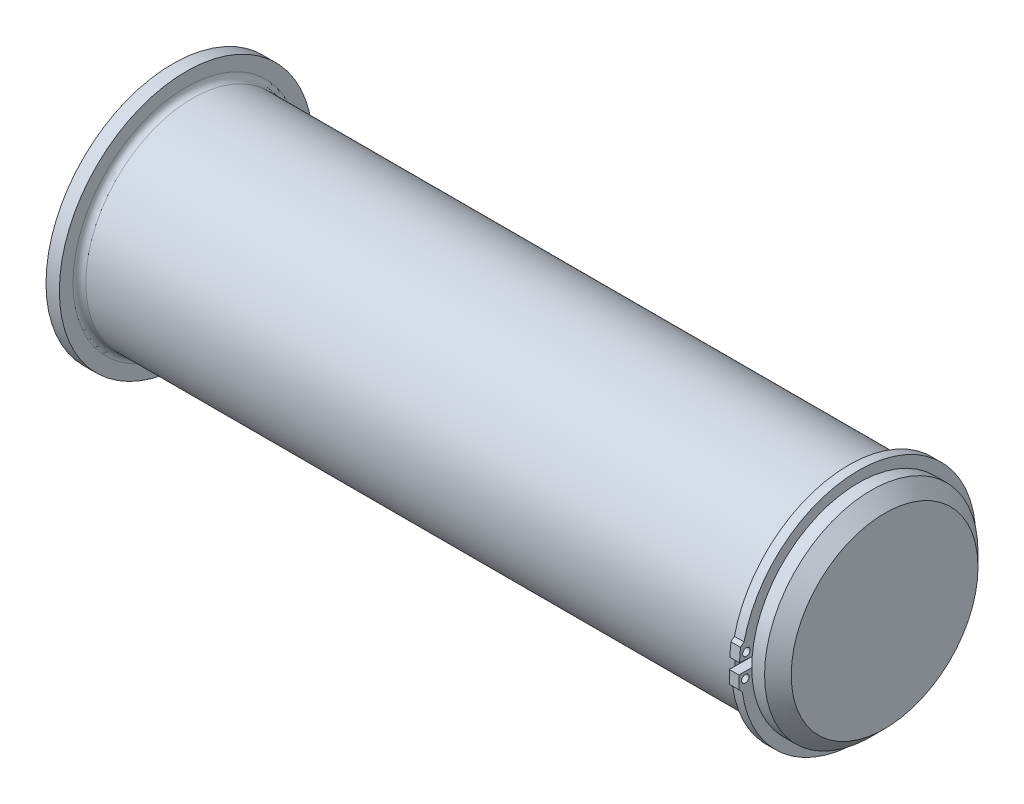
from build123d import *

# Parameters (mm, degrees)
BOSS_EXTRUDE1_START = 1.143
SKETCH5_R           = 0.4445
BOSS_EXTRUDE1_DEPTH = 1.143


with BuildPart() as part:
    # Sketch3 → Revolve1 (revolve)
    with BuildSketch(Plane.XY, mode=Mode.PRIVATE) as revolve1_sk:
        with BuildLine():
            Line((0, 0), (81.3435, 0))
            Line((81.3435, 0), (81.3435, 11.1125))
            Line((81.3435, 11.1125), (79.756, 12.7))
            Line((79.756, 12.7), (78.232, 12.7))
            Line((78.232, 12.7), (78.232, 11.049))
            Line((78.232, 11.049), (76.2, 11.049))
            Line((76.2, 11.049), (76.2, 12.7))
            Line((76.2, 12.7), (0, 12.7))
            Line((0, 12.7), (-1.016, 12.7))
            ThreePointArc((-1.016, 12.7), (-1.554815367, 12.923184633), (-1.778, 13.462))
            Line((-1.778, 13.462), (-1.778, 15.0876))
            Line((-1.778, 15.0876), (-3.3655, 15.0876))
            Line((-3.3655, 15.0876), (-3.3655, 0))
            Line((-3.3655, 0), (0, 0))
        make_face()
    revolve(revolve1_sk.sketch.rotate(Axis((0, 0, 0), (1, 0, 0)), 90), axis=Axis((0, 0, 0), (1, 0, 0)))

    # Sketch5 → Boss-Extrude1 (add)
    with BuildSketch(Plane.ZY.offset(-78.232).offset(BOSS_EXTRUDE1_START)):
        with BuildLine():
            Line((11.006955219, 0.962983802), (14.169873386, 1.239703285))
            Line((14.169873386, 1.239703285), (14.037048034, 2.757904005))
            Line((14.037048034, 2.757904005), (13.619898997, 3.107933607))
            ThreePointArc((13.619898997, 3.107933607), (-13.956703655, -0.609362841), (13.838945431, -1.909054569))
            Line((13.838945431, -1.909054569), (14.224, -1.524))
            Line((14.224, -1.524), (14.224, 0))
            Line((14.224, 0), (11.049, 0))
            ThreePointArc((11.049, 0), (-11.0384838, -0.481950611), (11.006955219, 0.962983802))
        make_face()
        with Locations((13.34436035, 1.932390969)):
            Circle(SKETCH5_R, mode=Mode.SUBTRACT)
        with Locations((13.462, -0.762)):
            Circle(SKETCH5_R, mode=Mode.SUBTRACT)
    extrude(amount=-BOSS_EXTRUDE1_DEPTH)


solid = part.part
